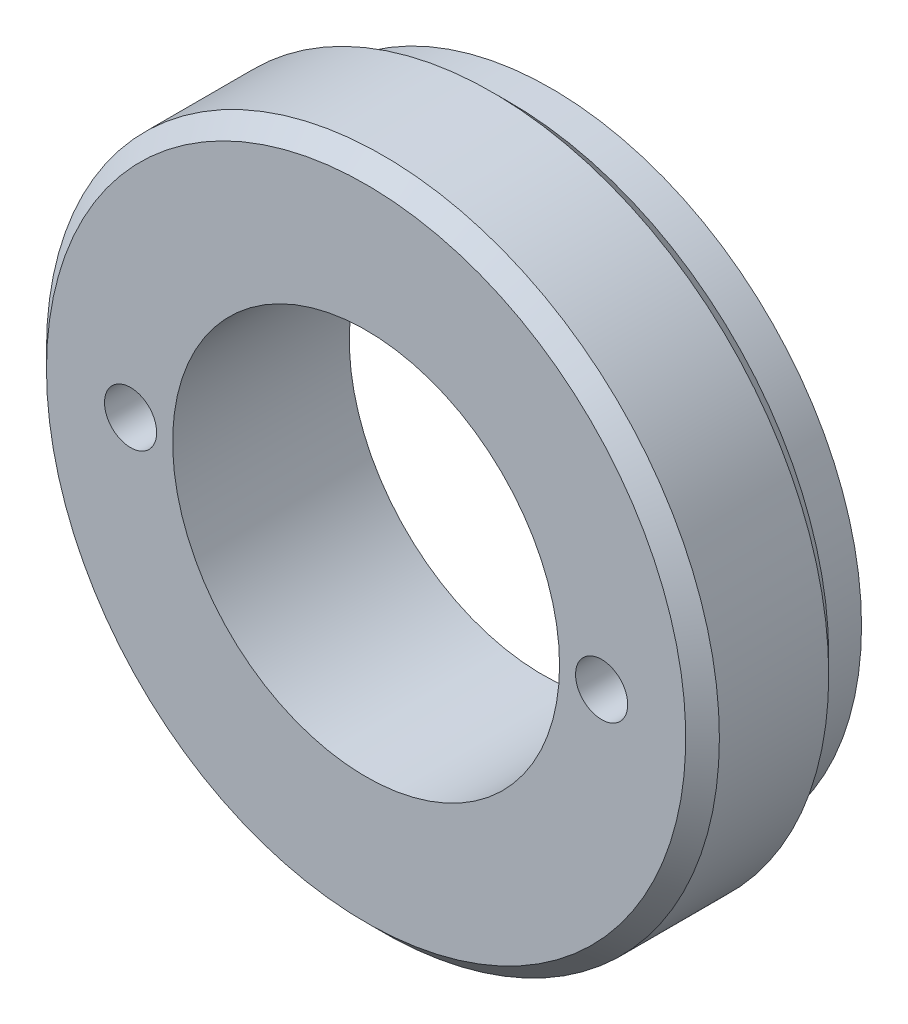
ISO-10303-21;
HEADER;
FILE_DESCRIPTION(('STEP AP214'),'2;1');
FILE_NAME('part.step','',(''),(''),'','','');
FILE_SCHEMA(('AUTOMOTIVE_DESIGN { 1 0 10303 214 1 1 1 1 }'));
ENDSEC;
DATA;
#1=APPLICATION_CONTEXT('core data for automotive mechanical design processes');
#2=APPLICATION_PROTOCOL_DEFINITION('international standard','automotive_design',2000,#1);
#3=PRODUCT_CONTEXT('',#1,'mechanical');
#4=PRODUCT('Part','Part','',(#3));
#5=PRODUCT_RELATED_PRODUCT_CATEGORY('part','',(#4));
#6=PRODUCT_DEFINITION_FORMATION('','',#4);
#7=PRODUCT_DEFINITION_CONTEXT('part definition',#1,'design');
#8=PRODUCT_DEFINITION('design','',#6,#7);
#9=PRODUCT_DEFINITION_SHAPE('','',#8);
#10=(LENGTH_UNIT() NAMED_UNIT(*) SI_UNIT(.MILLI.,.METRE.));
#11=(NAMED_UNIT(*) PLANE_ANGLE_UNIT() SI_UNIT($,.RADIAN.));
#12=(NAMED_UNIT(*) SI_UNIT($,.STERADIAN.) SOLID_ANGLE_UNIT());
#13=UNCERTAINTY_MEASURE_WITH_UNIT(LENGTH_MEASURE(1.E-05),#10,'distance_accuracy_value','');
#14=(GEOMETRIC_REPRESENTATION_CONTEXT(3) GLOBAL_UNCERTAINTY_ASSIGNED_CONTEXT((#13)) GLOBAL_UNIT_ASSIGNED_CONTEXT((#10,
#11,#12)) REPRESENTATION_CONTEXT('',''));
#15=CARTESIAN_POINT('',(0.,0.,0.));
#16=DIRECTION('',(0.,0.,1.));
#17=DIRECTION('',(1.,0.,0.));
#18=AXIS2_PLACEMENT_3D('',#15,#16,#17);
#19=CARTESIAN_POINT('',(0.,0.,-0.55000000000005));
#20=DIRECTION('',(0.,0.,1.));
#21=DIRECTION('',(1.,0.,0.));
#22=AXIS2_PLACEMENT_3D('',#19,#20,#21);
#23=CYLINDRICAL_SURFACE('',#22,18.45);
#24=CARTESIAN_POINT('',(0.,0.,0.));
#25=DIRECTION('',(0.,0.,1.));
#26=DIRECTION('',(1.,0.,0.));
#27=AXIS2_PLACEMENT_3D('',#24,#25,#26);
#28=CIRCLE('',#27,18.45);
#29=CARTESIAN_POINT('',(18.45,0.,0.));
#30=VERTEX_POINT('',#29);
#31=EDGE_CURVE('E19',#30,#30,#28,.T.);
#32=ORIENTED_EDGE('',*,*,#31,.T.);
#33=EDGE_LOOP('',(#32));
#34=FACE_BOUND('',#33,.T.);
#35=CARTESIAN_POINT('',(0.,0.,2.49999999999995));
#36=DIRECTION('',(0.,0.,1.));
#37=DIRECTION('',(1.,0.,0.));
#38=AXIS2_PLACEMENT_3D('',#35,#36,#37);
#39=CIRCLE('',#38,18.45);
#40=CARTESIAN_POINT('',(18.45,0.,2.49999999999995));
#41=VERTEX_POINT('',#40);
#42=EDGE_CURVE('E69',#41,#41,#39,.F.);
#43=ORIENTED_EDGE('',*,*,#42,.T.);
#44=EDGE_LOOP('',(#43));
#45=FACE_BOUND('',#44,.T.);
#46=ADVANCED_FACE('F16',(#34,#45),#23,.T.);
#47=CARTESIAN_POINT('',(0.,0.,0.));
#48=DIRECTION('',(0.,0.,1.));
#49=DIRECTION('',(1.,0.,0.));
#50=AXIS2_PLACEMENT_3D('',#47,#48,#49);
#51=PLANE('',#50);
#52=ORIENTED_EDGE('',*,*,#31,.F.);
#53=EDGE_LOOP('',(#52));
#54=FACE_BOUND('',#53,.T.);
#55=CARTESIAN_POINT('',(0.,0.,0.));
#56=DIRECTION('',(0.,0.,1.));
#57=DIRECTION('',(1.,0.,0.));
#58=AXIS2_PLACEMENT_3D('',#55,#56,#57);
#59=CIRCLE('',#58,17.85);
#60=CARTESIAN_POINT('',(17.85,0.,0.));
#61=VERTEX_POINT('',#60);
#62=EDGE_CURVE('E67',#61,#61,#59,.T.);
#63=ORIENTED_EDGE('',*,*,#62,.T.);
#64=EDGE_LOOP('',(#63));
#65=FACE_BOUND('',#64,.T.);
#66=ADVANCED_FACE('F77',(#54,#65),#51,.F.);
#67=CARTESIAN_POINT('',(0.,0.,2.49999999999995));
#68=DIRECTION('',(0.,0.,1.));
#69=DIRECTION('',(1.,0.,0.));
#70=AXIS2_PLACEMENT_3D('',#67,#68,#69);
#71=PLANE('',#70);
#72=CARTESIAN_POINT('',(0.,0.,2.49999999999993));
#73=DIRECTION('',(0.,0.,1.));
#74=DIRECTION('',(1.,0.,0.));
#75=AXIS2_PLACEMENT_3D('',#72,#73,#74);
#76=CIRCLE('',#75,19.0000000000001);
#77=CARTESIAN_POINT('',(19.0000000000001,0.,2.49999999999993));
#78=VERTEX_POINT('',#77);
#79=EDGE_CURVE('E64',#78,#78,#76,.T.);
#80=ORIENTED_EDGE('',*,*,#79,.F.);
#81=EDGE_LOOP('',(#80));
#82=FACE_BOUND('',#81,.T.);
#83=ORIENTED_EDGE('',*,*,#42,.F.);
#84=EDGE_LOOP('',(#83));
#85=FACE_BOUND('',#84,.T.);
#86=ADVANCED_FACE('F80',(#82,#85),#71,.F.);
#87=CARTESIAN_POINT('',(0.,0.,-0.55000000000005));
#88=DIRECTION('',(0.,0.,1.));
#89=DIRECTION('',(1.,0.,0.));
#90=AXIS2_PLACEMENT_3D('',#87,#88,#89);
#91=CYLINDRICAL_SURFACE('',#90,17.85);
#92=ORIENTED_EDGE('',*,*,#62,.F.);
#93=EDGE_LOOP('',(#92));
#94=FACE_BOUND('',#93,.T.);
#95=CARTESIAN_POINT('',(0.,0.,0.499999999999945));
#96=DIRECTION('',(0.,0.,1.));
#97=DIRECTION('',(1.,0.,0.));
#98=AXIS2_PLACEMENT_3D('',#95,#96,#97);
#99=CIRCLE('',#98,17.85);
#100=CARTESIAN_POINT('',(17.85,0.,0.499999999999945));
#101=VERTEX_POINT('',#100);
#102=EDGE_CURVE('E48',#101,#101,#99,.T.);
#103=ORIENTED_EDGE('',*,*,#102,.T.);
#104=EDGE_LOOP('',(#103));
#105=FACE_BOUND('',#104,.T.);
#106=ADVANCED_FACE('F83',(#94,#105),#91,.F.);
#107=CARTESIAN_POINT('',(0.,0.,3.50000000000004));
#108=DIRECTION('',(0.,0.,1.));
#109=DIRECTION('',(1.,0.,0.));
#110=AXIS2_PLACEMENT_3D('',#107,#108,#109);
#111=CONICAL_SURFACE('',#110,19.9999999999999,0.785398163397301);
#112=CARTESIAN_POINT('',(0.,0.,3.49999999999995));
#113=DIRECTION('',(0.,0.,1.));
#114=DIRECTION('',(1.,0.,0.));
#115=AXIS2_PLACEMENT_3D('',#112,#113,#114);
#116=CIRCLE('',#115,20.);
#117=CARTESIAN_POINT('',(20.,0.,3.49999999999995));
#118=VERTEX_POINT('',#117);
#119=EDGE_CURVE('E42',#118,#118,#116,.T.);
#120=ORIENTED_EDGE('',*,*,#119,.F.);
#121=EDGE_LOOP('',(#120));
#122=FACE_BOUND('',#121,.T.);
#123=ORIENTED_EDGE('',*,*,#79,.T.);
#124=EDGE_LOOP('',(#123));
#125=FACE_BOUND('',#124,.T.);
#126=ADVANCED_FACE('F35',(#122,#125),#111,.T.);
#127=CARTESIAN_POINT('',(-14.,0.,4.99999999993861));
#128=DIRECTION('',(0.,0.,1.));
#129=DIRECTION('',(1.,0.,0.));
#130=AXIS2_PLACEMENT_3D('',#127,#128,#129);
#131=CONICAL_SURFACE('',#130,1.54999999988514,1.08210413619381);
#132=CARTESIAN_POINT('',(-13.9999999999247,0.,4.17585038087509));
#133=VERTEX_POINT('',#132);
#134=VERTEX_LOOP('',#133);
#135=FACE_BOUND('',#134,.T.);
#136=CARTESIAN_POINT('',(-14.,0.,5.));
#137=DIRECTION('',(0.,0.,1.));
#138=DIRECTION('',(1.,0.,0.));
#139=AXIS2_PLACEMENT_3D('',#136,#137,#138);
#140=CIRCLE('',#139,1.55);
#141=CARTESIAN_POINT('',(-12.45,0.,5.));
#142=VERTEX_POINT('',#141);
#143=EDGE_CURVE('E39',#142,#142,#140,.T.);
#144=ORIENTED_EDGE('',*,*,#143,.T.);
#145=EDGE_LOOP('',(#144));
#146=FACE_BOUND('',#145,.T.);
#147=ADVANCED_FACE('F31',(#135,#146),#131,.F.);
#148=CARTESIAN_POINT('',(0.,0.,0.499999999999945));
#149=DIRECTION('',(0.,0.,1.));
#150=DIRECTION('',(1.,0.,0.));
#151=AXIS2_PLACEMENT_3D('',#148,#149,#150);
#152=PLANE('',#151);
#153=ORIENTED_EDGE('',*,*,#102,.F.);
#154=EDGE_LOOP('',(#153));
#155=FACE_BOUND('',#154,.T.);
#156=CARTESIAN_POINT('',(0.,0.,0.499999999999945));
#157=DIRECTION('',(0.,0.,1.));
#158=DIRECTION('',(1.,0.,0.));
#159=AXIS2_PLACEMENT_3D('',#156,#157,#158);
#160=CIRCLE('',#159,11.5);
#161=CARTESIAN_POINT('',(11.5,0.,0.499999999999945));
#162=VERTEX_POINT('',#161);
#163=EDGE_CURVE('E41',#162,#162,#160,.T.);
#164=ORIENTED_EDGE('',*,*,#163,.T.);
#165=EDGE_LOOP('',(#164));
#166=FACE_BOUND('',#165,.T.);
#167=ADVANCED_FACE('F34',(#155,#166),#152,.F.);
#168=CARTESIAN_POINT('',(14.,0.,4.99999999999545));
#169=DIRECTION('',(0.,0.,1.));
#170=DIRECTION('',(1.,0.,0.));
#171=AXIS2_PLACEMENT_3D('',#168,#169,#170);
#172=CONICAL_SURFACE('',#171,1.55000000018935,1.08210413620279);
#173=CARTESIAN_POINT('',(14.00000000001,0.,4.1758503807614));
#174=VERTEX_POINT('',#173);
#175=VERTEX_LOOP('',#174);
#176=FACE_BOUND('',#175,.T.);
#177=CARTESIAN_POINT('',(14.,0.,5.));
#178=DIRECTION('',(0.,0.,1.));
#179=DIRECTION('',(1.,0.,0.));
#180=AXIS2_PLACEMENT_3D('',#177,#178,#179);
#181=CIRCLE('',#180,1.55);
#182=CARTESIAN_POINT('',(15.55,0.,5.));
#183=VERTEX_POINT('',#182);
#184=EDGE_CURVE('E45',#183,#183,#181,.T.);
#185=ORIENTED_EDGE('',*,*,#184,.T.);
#186=EDGE_LOOP('',(#185));
#187=FACE_BOUND('',#186,.T.);
#188=ADVANCED_FACE('F91',(#176,#187),#172,.F.);
#189=CARTESIAN_POINT('',(0.,0.,-0.55000000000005));
#190=DIRECTION('',(0.,0.,1.));
#191=DIRECTION('',(1.,0.,0.));
#192=AXIS2_PLACEMENT_3D('',#189,#190,#191);
#193=CYLINDRICAL_SURFACE('',#192,20.);
#194=CARTESIAN_POINT('',(0.,0.,9.9999999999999));
#195=DIRECTION('',(0.,0.,-1.));
#196=DIRECTION('',(-1.,0.,0.));
#197=AXIS2_PLACEMENT_3D('',#194,#195,#196);
#198=CIRCLE('',#197,19.9999999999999);
#199=CARTESIAN_POINT('',(-19.9999999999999,0.,9.9999999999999));
#200=VERTEX_POINT('',#199);
#201=EDGE_CURVE('E60',#200,#200,#198,.F.);
#202=ORIENTED_EDGE('',*,*,#201,.F.);
#203=EDGE_LOOP('',(#202));
#204=FACE_BOUND('',#203,.T.);
#205=ORIENTED_EDGE('',*,*,#119,.T.);
#206=EDGE_LOOP('',(#205));
#207=FACE_BOUND('',#206,.T.);
#208=ADVANCED_FACE('F112',(#204,#207),#193,.T.);
#209=CARTESIAN_POINT('',(-14.,0.,3.83464289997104));
#210=DIRECTION('',(0.,0.,1.));
#211=DIRECTION('',(1.,0.,0.));
#212=AXIS2_PLACEMENT_3D('',#209,#210,#211);
#213=CYLINDRICAL_SURFACE('',#212,1.55);
#214=ORIENTED_EDGE('',*,*,#143,.F.);
#215=EDGE_LOOP('',(#214));
#216=FACE_BOUND('',#215,.T.);
#217=CARTESIAN_POINT('',(-14.,0.,11.));
#218=DIRECTION('',(0.,0.,1.));
#219=DIRECTION('',(1.,0.,0.));
#220=AXIS2_PLACEMENT_3D('',#217,#218,#219);
#221=CIRCLE('',#220,1.55);
#222=CARTESIAN_POINT('',(-12.45,0.,11.));
#223=VERTEX_POINT('',#222);
#224=EDGE_CURVE('E58',#223,#223,#221,.F.);
#225=ORIENTED_EDGE('',*,*,#224,.F.);
#226=EDGE_LOOP('',(#225));
#227=FACE_BOUND('',#226,.T.);
#228=ADVANCED_FACE('F99',(#216,#227),#213,.F.);
#229=CARTESIAN_POINT('',(0.,0.,-0.55000000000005));
#230=DIRECTION('',(0.,0.,1.));
#231=DIRECTION('',(1.,0.,0.));
#232=AXIS2_PLACEMENT_3D('',#229,#230,#231);
#233=CYLINDRICAL_SURFACE('',#232,11.5);
#234=ORIENTED_EDGE('',*,*,#163,.F.);
#235=EDGE_LOOP('',(#234));
#236=FACE_BOUND('',#235,.T.);
#237=CARTESIAN_POINT('',(0.,0.,11.));
#238=DIRECTION('',(0.,0.,1.));
#239=DIRECTION('',(1.,0.,0.));
#240=AXIS2_PLACEMENT_3D('',#237,#238,#239);
#241=CIRCLE('',#240,11.5);
#242=CARTESIAN_POINT('',(11.5,0.,11.));
#243=VERTEX_POINT('',#242);
#244=EDGE_CURVE('E55',#243,#243,#241,.F.);
#245=ORIENTED_EDGE('',*,*,#244,.F.);
#246=EDGE_LOOP('',(#245));
#247=FACE_BOUND('',#246,.T.);
#248=ADVANCED_FACE('F95',(#236,#247),#233,.F.);
#249=CARTESIAN_POINT('',(14.,0.,3.83464289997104));
#250=DIRECTION('',(0.,0.,1.));
#251=DIRECTION('',(1.,0.,0.));
#252=AXIS2_PLACEMENT_3D('',#249,#250,#251);
#253=CYLINDRICAL_SURFACE('',#252,1.55);
#254=ORIENTED_EDGE('',*,*,#184,.F.);
#255=EDGE_LOOP('',(#254));
#256=FACE_BOUND('',#255,.T.);
#257=CARTESIAN_POINT('',(14.,0.,11.));
#258=DIRECTION('',(0.,0.,1.));
#259=DIRECTION('',(1.,0.,0.));
#260=AXIS2_PLACEMENT_3D('',#257,#258,#259);
#261=CIRCLE('',#260,1.55);
#262=CARTESIAN_POINT('',(15.55,0.,11.));
#263=VERTEX_POINT('',#262);
#264=EDGE_CURVE('E25',#263,#263,#261,.F.);
#265=ORIENTED_EDGE('',*,*,#264,.F.);
#266=EDGE_LOOP('',(#265));
#267=FACE_BOUND('',#266,.T.);
#268=ADVANCED_FACE('F98',(#256,#267),#253,.F.);
#269=CARTESIAN_POINT('',(0.,0.,9.9999999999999));
#270=DIRECTION('',(0.,0.,-1.));
#271=DIRECTION('',(-1.,0.,0.));
#272=AXIS2_PLACEMENT_3D('',#269,#270,#271);
#273=CONICAL_SURFACE('',#272,19.9999999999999,0.785398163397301);
#274=ORIENTED_EDGE('',*,*,#201,.T.);
#275=EDGE_LOOP('',(#274));
#276=FACE_BOUND('',#275,.T.);
#277=CARTESIAN_POINT('',(0.,0.,11.0000000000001));
#278=DIRECTION('',(0.,0.,-1.));
#279=DIRECTION('',(-1.,0.,0.));
#280=AXIS2_PLACEMENT_3D('',#277,#278,#279);
#281=CIRCLE('',#280,19.);
#282=CARTESIAN_POINT('',(-19.,0.,11.0000000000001));
#283=VERTEX_POINT('',#282);
#284=EDGE_CURVE('E11',#283,#283,#281,.F.);
#285=ORIENTED_EDGE('',*,*,#284,.F.);
#286=EDGE_LOOP('',(#285));
#287=FACE_BOUND('',#286,.T.);
#288=ADVANCED_FACE('F106',(#276,#287),#273,.T.);
#289=CARTESIAN_POINT('',(0.,0.,11.));
#290=DIRECTION('',(0.,0.,1.));
#291=DIRECTION('',(1.,0.,0.));
#292=AXIS2_PLACEMENT_3D('',#289,#290,#291);
#293=PLANE('',#292);
#294=ORIENTED_EDGE('',*,*,#284,.T.);
#295=EDGE_LOOP('',(#294));
#296=FACE_BOUND('',#295,.T.);
#297=ORIENTED_EDGE('',*,*,#264,.T.);
#298=EDGE_LOOP('',(#297));
#299=FACE_BOUND('',#298,.T.);
#300=ORIENTED_EDGE('',*,*,#244,.T.);
#301=EDGE_LOOP('',(#300));
#302=FACE_BOUND('',#301,.T.);
#303=ORIENTED_EDGE('',*,*,#224,.T.);
#304=EDGE_LOOP('',(#303));
#305=FACE_BOUND('',#304,.T.);
#306=ADVANCED_FACE('F103',(#296,#299,#302,#305),#293,.T.);
#307=CLOSED_SHELL('',(#46,#66,#86,#106,#126,#147,#167,#188,#208,#228,#248,#268,#288,#306));
#308=MANIFOLD_SOLID_BREP('B1',#307);
#309=ADVANCED_BREP_SHAPE_REPRESENTATION('',(#18,#308),#14);
#310=SHAPE_DEFINITION_REPRESENTATION(#9,#309);
ENDSEC;
END-ISO-10303-21;
